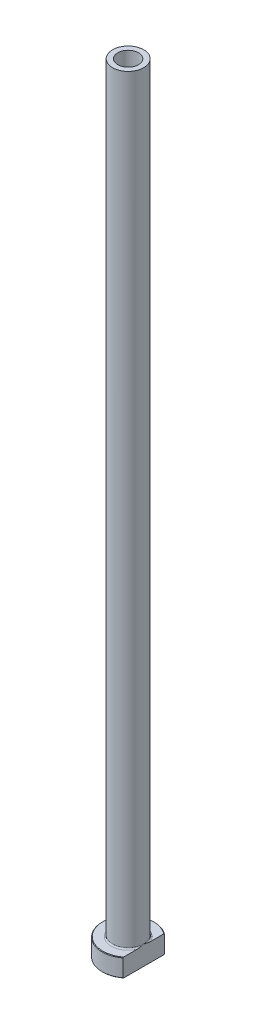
ISO-10303-21;
HEADER;
FILE_DESCRIPTION(('STEP AP214'),'2;1');
FILE_NAME('part.step','',(''),(''),'','','');
FILE_SCHEMA(('AUTOMOTIVE_DESIGN { 1 0 10303 214 1 1 1 1 }'));
ENDSEC;
DATA;
#1=APPLICATION_CONTEXT('core data for automotive mechanical design processes');
#2=APPLICATION_PROTOCOL_DEFINITION('international standard','automotive_design',2000,#1);
#3=PRODUCT_CONTEXT('',#1,'mechanical');
#4=PRODUCT('Part','Part','',(#3));
#5=PRODUCT_RELATED_PRODUCT_CATEGORY('part','',(#4));
#6=PRODUCT_DEFINITION_FORMATION('','',#4);
#7=PRODUCT_DEFINITION_CONTEXT('part definition',#1,'design');
#8=PRODUCT_DEFINITION('design','',#6,#7);
#9=PRODUCT_DEFINITION_SHAPE('','',#8);
#10=(LENGTH_UNIT() NAMED_UNIT(*) SI_UNIT(.MILLI.,.METRE.));
#11=(NAMED_UNIT(*) PLANE_ANGLE_UNIT() SI_UNIT($,.RADIAN.));
#12=(NAMED_UNIT(*) SI_UNIT($,.STERADIAN.) SOLID_ANGLE_UNIT());
#13=UNCERTAINTY_MEASURE_WITH_UNIT(LENGTH_MEASURE(1.E-05),#10,'distance_accuracy_value','');
#14=(GEOMETRIC_REPRESENTATION_CONTEXT(3) GLOBAL_UNCERTAINTY_ASSIGNED_CONTEXT((#13)) GLOBAL_UNIT_ASSIGNED_CONTEXT((#10,
#11,#12)) REPRESENTATION_CONTEXT('',''));
#15=CARTESIAN_POINT('',(0.,0.,0.));
#16=DIRECTION('',(0.,0.,1.));
#17=DIRECTION('',(1.,0.,0.));
#18=AXIS2_PLACEMENT_3D('',#15,#16,#17);
#19=CARTESIAN_POINT('',(0.,92.1876809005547,0.));
#20=DIRECTION('',(0.,1.,0.));
#21=DIRECTION('',(0.,0.,1.));
#22=AXIS2_PLACEMENT_3D('',#19,#20,#21);
#23=CYLINDRICAL_SURFACE('',#22,4.00000000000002);
#24=CARTESIAN_POINT('',(0.,300.,0.));
#25=DIRECTION('',(0.,1.,0.));
#26=DIRECTION('',(0.,0.,1.));
#27=AXIS2_PLACEMENT_3D('',#24,#25,#26);
#28=CIRCLE('',#27,4.00000000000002);
#29=CARTESIAN_POINT('',(0.,300.,4.00000000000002));
#30=VERTEX_POINT('',#29);
#31=EDGE_CURVE('E167',#30,#30,#28,.T.);
#32=ORIENTED_EDGE('',*,*,#31,.T.);
#33=EDGE_LOOP('',(#32));
#34=FACE_BOUND('',#33,.T.);
#35=CARTESIAN_POINT('',(0.,255.,0.));
#36=DIRECTION('',(0.,1.,0.));
#37=DIRECTION('',(0.,0.,1.));
#38=AXIS2_PLACEMENT_3D('',#35,#36,#37);
#39=CIRCLE('',#38,4.00000000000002);
#40=CARTESIAN_POINT('',(0.,255.,4.00000000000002));
#41=VERTEX_POINT('',#40);
#42=EDGE_CURVE('E170',#41,#41,#39,.T.);
#43=ORIENTED_EDGE('',*,*,#42,.F.);
#44=EDGE_LOOP('',(#43));
#45=FACE_BOUND('',#44,.T.);
#46=ADVANCED_FACE('F32',(#34,#45),#23,.F.);
#47=CARTESIAN_POINT('',(-4.00000000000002,300.,0.));
#48=DIRECTION('',(0.,1.,0.));
#49=DIRECTION('',(0.,0.,1.));
#50=AXIS2_PLACEMENT_3D('',#47,#48,#49);
#51=PLANE('',#50);
#52=CARTESIAN_POINT('',(0.,300.,0.));
#53=DIRECTION('',(0.,1.,0.));
#54=DIRECTION('',(0.,0.,1.));
#55=AXIS2_PLACEMENT_3D('',#52,#53,#54);
#56=CIRCLE('',#55,6.00000000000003);
#57=CARTESIAN_POINT('',(0.,300.,6.00000000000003));
#58=VERTEX_POINT('',#57);
#59=EDGE_CURVE('E174',#58,#58,#56,.T.);
#60=ORIENTED_EDGE('',*,*,#59,.T.);
#61=EDGE_LOOP('',(#60));
#62=FACE_BOUND('',#61,.T.);
#63=ORIENTED_EDGE('',*,*,#31,.F.);
#64=EDGE_LOOP('',(#63));
#65=FACE_BOUND('',#64,.T.);
#66=ADVANCED_FACE('F157',(#62,#65),#51,.T.);
#67=CARTESIAN_POINT('',(0.,92.1876809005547,0.));
#68=DIRECTION('',(0.,1.,0.));
#69=DIRECTION('',(0.,0.,1.));
#70=AXIS2_PLACEMENT_3D('',#67,#68,#69);
#71=CYLINDRICAL_SURFACE('',#70,6.00000000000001);
#72=CARTESIAN_POINT('',(0.,7.50000000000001,0.));
#73=DIRECTION('',(0.,1.,0.));
#74=DIRECTION('',(0.,0.,1.));
#75=AXIS2_PLACEMENT_3D('',#72,#73,#74);
#76=CIRCLE('',#75,6.00000000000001);
#77=CARTESIAN_POINT('',(6.,7.50000000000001,0.));
#78=VERTEX_POINT('',#77);
#79=EDGE_CURVE('E180',#78,#78,#76,.T.);
#80=ORIENTED_EDGE('',*,*,#79,.T.);
#81=EDGE_LOOP('',(#80));
#82=FACE_BOUND('',#81,.T.);
#83=ORIENTED_EDGE('',*,*,#59,.F.);
#84=EDGE_LOOP('',(#83));
#85=FACE_BOUND('',#84,.T.);
#86=ADVANCED_FACE('F162',(#82,#85),#71,.T.);
#87=CARTESIAN_POINT('',(-5.99999999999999,7.,0.));
#88=DIRECTION('',(0.,1.,0.));
#89=DIRECTION('',(0.,0.,1.));
#90=AXIS2_PLACEMENT_3D('',#87,#88,#89);
#91=PLANE('',#90);
#92=DIRECTION('',(0.,0.,1.));
#93=VECTOR('',#92,1.);
#94=CARTESIAN_POINT('',(6.,7.,0.));
#95=LINE('',#94,#93);
#96=CARTESIAN_POINT('',(6.,7.,-7.74854825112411));
#97=VERTEX_POINT('',#96);
#98=CARTESIAN_POINT('',(6.,7.,-2.50000000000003));
#99=VERTEX_POINT('',#98);
#100=EDGE_CURVE('E54',#97,#99,#95,.T.);
#101=ORIENTED_EDGE('',*,*,#100,.F.);
#102=CARTESIAN_POINT('',(0.,7.,0.));
#103=DIRECTION('',(0.,1.,0.));
#104=DIRECTION('',(0.,0.,1.));
#105=AXIS2_PLACEMENT_3D('',#102,#103,#104);
#106=CIRCLE('',#105,9.79999999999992);
#107=CARTESIAN_POINT('',(5.99999999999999,7.,7.74854825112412));
#108=VERTEX_POINT('',#107);
#109=EDGE_CURVE('E186',#97,#108,#106,.T.);
#110=ORIENTED_EDGE('',*,*,#109,.T.);
#111=CARTESIAN_POINT('',(6.,7.,2.50000000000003));
#112=VERTEX_POINT('',#111);
#113=EDGE_CURVE('E134',#112,#108,#95,.T.);
#114=ORIENTED_EDGE('',*,*,#113,.F.);
#115=CARTESIAN_POINT('',(0.,7.,0.));
#116=DIRECTION('',(0.,1.,0.));
#117=DIRECTION('',(0.,0.,1.));
#118=AXIS2_PLACEMENT_3D('',#115,#116,#117);
#119=CIRCLE('',#118,6.50000000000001);
#120=EDGE_CURVE('E183',#112,#99,#119,.F.);
#121=ORIENTED_EDGE('',*,*,#120,.T.);
#122=EDGE_LOOP('',(#101,#110,#114,#121));
#123=FACE_BOUND('',#122,.T.);
#124=ADVANCED_FACE('F197',(#123),#91,.T.);
#125=CARTESIAN_POINT('',(0.,92.1876809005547,0.));
#126=DIRECTION('',(0.,1.,0.));
#127=DIRECTION('',(0.,0.,1.));
#128=AXIS2_PLACEMENT_3D('',#125,#126,#127);
#129=CYLINDRICAL_SURFACE('',#128,9.99999999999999);
#130=DIRECTION('',(0.,-1.,0.));
#131=VECTOR('',#130,1.);
#132=CARTESIAN_POINT('',(5.99999999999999,300.,7.99999999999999));
#133=LINE('',#132,#131);
#134=CARTESIAN_POINT('',(5.99999999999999,6.79999999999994,7.99999999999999));
#135=VERTEX_POINT('',#134);
#136=CARTESIAN_POINT('',(5.99999999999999,0.200000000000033,7.99999999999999));
#137=VERTEX_POINT('',#136);
#138=EDGE_CURVE('E82',#135,#137,#133,.T.);
#139=ORIENTED_EDGE('',*,*,#138,.F.);
#140=CARTESIAN_POINT('',(0.,6.79999999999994,0.));
#141=DIRECTION('',(0.,1.,0.));
#142=DIRECTION('',(0.,0.,1.));
#143=AXIS2_PLACEMENT_3D('',#140,#141,#142);
#144=CIRCLE('',#143,9.99999999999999);
#145=CARTESIAN_POINT('',(6.,6.79999999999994,-7.99999999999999));
#146=VERTEX_POINT('',#145);
#147=EDGE_CURVE('E95',#135,#146,#144,.F.);
#148=ORIENTED_EDGE('',*,*,#147,.T.);
#149=DIRECTION('',(0.,-1.,0.));
#150=VECTOR('',#149,1.);
#151=CARTESIAN_POINT('',(6.,300.,-7.99999999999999));
#152=LINE('',#151,#150);
#153=CARTESIAN_POINT('',(6.,0.200000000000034,-7.99999999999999));
#154=VERTEX_POINT('',#153);
#155=EDGE_CURVE('E192',#146,#154,#152,.T.);
#156=ORIENTED_EDGE('',*,*,#155,.T.);
#157=CARTESIAN_POINT('',(0.,0.200000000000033,0.));
#158=DIRECTION('',(0.,-1.,0.));
#159=DIRECTION('',(0.,0.,-1.));
#160=AXIS2_PLACEMENT_3D('',#157,#158,#159);
#161=CIRCLE('',#160,9.99999999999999);
#162=EDGE_CURVE('E98',#154,#137,#161,.F.);
#163=ORIENTED_EDGE('',*,*,#162,.T.);
#164=EDGE_LOOP('',(#139,#148,#156,#163));
#165=FACE_BOUND('',#164,.T.);
#166=ADVANCED_FACE('F190',(#165),#129,.T.);
#167=CARTESIAN_POINT('',(-9.99999999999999,0.,0.));
#168=DIRECTION('',(0.,-1.,0.));
#169=DIRECTION('',(0.,0.,-1.));
#170=AXIS2_PLACEMENT_3D('',#167,#168,#169);
#171=PLANE('',#170);
#172=CARTESIAN_POINT('',(0.,0.,0.));
#173=DIRECTION('',(0.,-1.,0.));
#174=DIRECTION('',(0.,0.,-1.));
#175=AXIS2_PLACEMENT_3D('',#172,#173,#174);
#176=CIRCLE('',#175,4.75);
#177=CARTESIAN_POINT('',(0.,0.,-4.75));
#178=VERTEX_POINT('',#177);
#179=EDGE_CURVE('E40',#178,#178,#176,.F.);
#180=ORIENTED_EDGE('',*,*,#179,.T.);
#181=EDGE_LOOP('',(#180));
#182=FACE_BOUND('',#181,.T.);
#183=DIRECTION('',(0.,0.,-1.));
#184=VECTOR('',#183,1.);
#185=CARTESIAN_POINT('',(5.99999999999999,0.,7.99999999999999));
#186=LINE('',#185,#184);
#187=CARTESIAN_POINT('',(5.99999999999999,0.,7.74854825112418));
#188=VERTEX_POINT('',#187);
#189=CARTESIAN_POINT('',(6.,0.,-7.74854825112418));
#190=VERTEX_POINT('',#189);
#191=EDGE_CURVE('E47',#188,#190,#186,.T.);
#192=ORIENTED_EDGE('',*,*,#191,.F.);
#193=CARTESIAN_POINT('',(0.,0.,0.));
#194=DIRECTION('',(0.,-1.,0.));
#195=DIRECTION('',(0.,0.,-1.));
#196=AXIS2_PLACEMENT_3D('',#193,#194,#195);
#197=CIRCLE('',#196,9.79999999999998);
#198=EDGE_CURVE('E92',#188,#190,#197,.T.);
#199=ORIENTED_EDGE('',*,*,#198,.T.);
#200=EDGE_LOOP('',(#192,#199));
#201=FACE_BOUND('',#200,.T.);
#202=ADVANCED_FACE('F91',(#182,#201),#171,.T.);
#203=CARTESIAN_POINT('',(0.,92.1876809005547,0.));
#204=DIRECTION('',(0.,1.,0.));
#205=DIRECTION('',(0.,0.,1.));
#206=AXIS2_PLACEMENT_3D('',#203,#204,#205);
#207=CYLINDRICAL_SURFACE('',#206,4.25000000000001);
#208=CARTESIAN_POINT('',(0.,0.500000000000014,0.));
#209=DIRECTION('',(0.,-1.,0.));
#210=DIRECTION('',(0.,0.,-1.));
#211=AXIS2_PLACEMENT_3D('',#208,#209,#210);
#212=CIRCLE('',#211,4.25000000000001);
#213=CARTESIAN_POINT('',(0.,0.500000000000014,-4.25000000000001));
#214=VERTEX_POINT('',#213);
#215=EDGE_CURVE('E11',#214,#214,#212,.T.);
#216=ORIENTED_EDGE('',*,*,#215,.T.);
#217=EDGE_LOOP('',(#216));
#218=FACE_BOUND('',#217,.T.);
#219=CARTESIAN_POINT('',(0.,243.,0.));
#220=DIRECTION('',(0.,1.,0.));
#221=DIRECTION('',(0.,0.,1.));
#222=AXIS2_PLACEMENT_3D('',#219,#220,#221);
#223=CIRCLE('',#222,4.25000000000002);
#224=CARTESIAN_POINT('',(0.,243.,4.25000000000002));
#225=VERTEX_POINT('',#224);
#226=EDGE_CURVE('E172',#225,#225,#223,.T.);
#227=ORIENTED_EDGE('',*,*,#226,.T.);
#228=EDGE_LOOP('',(#227));
#229=FACE_BOUND('',#228,.T.);
#230=ADVANCED_FACE('F215',(#218,#229),#207,.F.);
#231=CARTESIAN_POINT('',(0.,243.,0.));
#232=DIRECTION('',(0.,-1.,0.));
#233=DIRECTION('',(0.,0.,-1.));
#234=AXIS2_PLACEMENT_3D('',#231,#232,#233);
#235=CONICAL_SURFACE('',#234,4.25000000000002,0.0208303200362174);
#236=ORIENTED_EDGE('',*,*,#42,.T.);
#237=EDGE_LOOP('',(#236));
#238=FACE_BOUND('',#237,.T.);
#239=ORIENTED_EDGE('',*,*,#226,.F.);
#240=EDGE_LOOP('',(#239));
#241=FACE_BOUND('',#240,.T.);
#242=ADVANCED_FACE('F111',(#238,#241),#235,.F.);
#243=CARTESIAN_POINT('',(0.,7.50000000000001,0.));
#244=DIRECTION('',(0.,1.,0.));
#245=DIRECTION('',(0.,0.,1.));
#246=AXIS2_PLACEMENT_3D('',#243,#244,#245);
#247=TOROIDAL_SURFACE('',#246,6.50000000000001,0.5);
#248=ORIENTED_EDGE('',*,*,#120,.F.);
#249=CARTESIAN_POINT('',(6.,7.50000000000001,0.));
#250=CARTESIAN_POINT('',(6.,7.50000080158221,6.70580405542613E-11));
#251=CARTESIAN_POINT('',(6.,7.5000016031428,2.62462853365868E-07));
#252=CARTESIAN_POINT('',(6.,7.50000311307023,1.01907229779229E-06));
#253=CARTESIAN_POINT('',(6.,7.50000381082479,1.52837979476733E-06));
#254=CARTESIAN_POINT('',(6.,7.50000523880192,2.74467686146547E-06));
#255=CARTESIAN_POINT('',(6.,7.50000595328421,3.47066811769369E-06));
#256=CARTESIAN_POINT('',(6.,7.50000725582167,4.99336283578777E-06));
#257=CARTESIAN_POINT('',(6.,7.50000784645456,5.78800222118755E-06));
#258=CARTESIAN_POINT('',(6.,7.50000997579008,8.79661743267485E-06));
#259=CARTESIAN_POINT('',(6.,7.50001139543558,1.1098069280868E-05));
#260=CARTESIAN_POINT('',(6.,7.50001378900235,1.5711611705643E-05));
#261=CARTESIAN_POINT('',(6.,7.50001478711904,1.80117463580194E-05));
#262=CARTESIAN_POINT('',(6.,7.50001885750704,2.75423873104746E-05));
#263=CARTESIAN_POINT('',(6.,7.50002181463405,3.48285128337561E-05));
#264=CARTESIAN_POINT('',(6.,7.50002628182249,4.87408453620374E-05));
#265=CARTESIAN_POINT('',(6.,7.50002793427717,5.53214434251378E-05));
#266=CARTESIAN_POINT('',(6.,7.50003978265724,0.00010360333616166));
#267=CARTESIAN_POINT('',(6.,7.50004857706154,0.000145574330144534));
#268=CARTESIAN_POINT('',(6.,7.50008704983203,0.000310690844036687));
#269=CARTESIAN_POINT('',(6.,7.50012394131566,0.000432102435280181));
#270=CARTESIAN_POINT('',(6.,7.50026686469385,0.000911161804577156));
#271=CARTESIAN_POINT('',(6.,7.50036807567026,0.00126981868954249));
#272=CARTESIAN_POINT('',(6.,7.50077195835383,0.00268961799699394));
#273=CARTESIAN_POINT('',(6.,7.5010805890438,0.00374948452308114));
#274=CARTESIAN_POINT('',(6.,7.50236320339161,0.0081665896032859));
#275=CARTESIAN_POINT('',(6.,7.5033297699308,0.0115254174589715));
#276=CARTESIAN_POINT('',(5.99999999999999,7.51709820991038,0.059354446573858));
#277=CARTESIAN_POINT('',(6.,7.52995465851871,0.103813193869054));
#278=CARTESIAN_POINT('',(6.,7.55506029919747,0.190977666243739));
#279=CARTESIAN_POINT('',(6.,7.56731321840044,0.233682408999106));
#280=CARTESIAN_POINT('',(6.,7.59325665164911,0.324512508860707));
#281=CARTESIAN_POINT('',(6.,7.60693346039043,0.372641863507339));
#282=CARTESIAN_POINT('',(6.,7.63422038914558,0.469489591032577));
#283=CARTESIAN_POINT('',(6.,7.6478281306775,0.518208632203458));
#284=CARTESIAN_POINT('',(6.,7.68043734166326,0.636338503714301));
#285=CARTESIAN_POINT('',(6.,7.69928754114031,0.705791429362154));
#286=CARTESIAN_POINT('',(6.,7.73566887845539,0.84310273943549));
#287=CARTESIAN_POINT('',(6.,7.75322160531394,0.910955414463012));
#288=CARTESIAN_POINT('',(6.,7.80024878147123,1.09857433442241));
#289=CARTESIAN_POINT('',(6.,7.82864900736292,1.21861610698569));
#290=CARTESIAN_POINT('',(6.,7.88105633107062,1.46081534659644));
#291=CARTESIAN_POINT('',(6.,7.90502088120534,1.58298212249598));
#292=CARTESIAN_POINT('',(6.,7.94810499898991,1.83866408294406));
#293=CARTESIAN_POINT('',(6.,7.96665856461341,1.97228081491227));
#294=CARTESIAN_POINT('',(6.,7.9862169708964,2.17329578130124));
#295=CARTESIAN_POINT('',(6.,7.99135613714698,2.24029152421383));
#296=CARTESIAN_POINT('',(6.,7.99832928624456,2.37444824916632));
#297=CARTESIAN_POINT('',(6.,8.00016429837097,2.44160917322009));
#298=CARTESIAN_POINT('',(6.,7.99984674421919,2.56298631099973));
#299=CARTESIAN_POINT('',(6.,7.99839439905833,2.6172032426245));
#300=CARTESIAN_POINT('',(6.,7.9923655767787,2.72552036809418));
#301=CARTESIAN_POINT('',(6.,7.98778645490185,2.77962042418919));
#302=CARTESIAN_POINT('',(6.,7.97492915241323,2.88664710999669));
#303=CARTESIAN_POINT('',(6.,7.96670262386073,2.939579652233));
#304=CARTESIAN_POINT('',(6.,7.94570253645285,3.0444833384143));
#305=CARTESIAN_POINT('',(6.,7.93293488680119,3.09645563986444));
#306=CARTESIAN_POINT('',(6.,7.90135968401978,3.19943606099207));
#307=CARTESIAN_POINT('',(6.,7.88247175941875,3.25042120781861));
#308=CARTESIAN_POINT('',(6.,7.84818685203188,3.32403783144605));
#309=CARTESIAN_POINT('',(6.,7.83579052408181,3.34806431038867));
#310=CARTESIAN_POINT('',(6.,7.80866016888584,3.39474488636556));
#311=CARTESIAN_POINT('',(6.,7.7939296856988,3.41740099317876));
#312=CARTESIAN_POINT('',(6.,7.76577135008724,3.4552417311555));
#313=CARTESIAN_POINT('',(6.,7.75294719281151,3.4708726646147));
#314=CARTESIAN_POINT('',(6.,7.72556313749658,3.50058040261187));
#315=CARTESIAN_POINT('',(6.,7.71100204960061,3.51465612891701));
#316=CARTESIAN_POINT('',(6.,7.67984897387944,3.54077006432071));
#317=CARTESIAN_POINT('',(6.,7.66323651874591,3.55278430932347));
#318=CARTESIAN_POINT('',(6.,7.62815222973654,3.57370259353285));
#319=CARTESIAN_POINT('',(6.,7.6096850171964,3.58261412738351));
#320=CARTESIAN_POINT('',(6.,7.57639898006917,3.59454653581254));
#321=CARTESIAN_POINT('',(6.,7.56191673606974,3.59850385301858));
#322=CARTESIAN_POINT('',(6.,7.53249228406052,3.60392336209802));
#323=CARTESIAN_POINT('',(6.,7.51755044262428,3.60538749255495));
#324=CARTESIAN_POINT('',(6.,7.48761833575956,3.60568912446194));
#325=CARTESIAN_POINT('',(6.,7.47262803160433,3.60452285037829));
#326=CARTESIAN_POINT('',(6.,7.4430627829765,3.59966500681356));
#327=CARTESIAN_POINT('',(6.,7.4284881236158,3.59597174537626));
#328=CARTESIAN_POINT('',(6.,7.39702156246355,3.58531109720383));
#329=CARTESIAN_POINT('',(6.,7.38031267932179,3.57780732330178));
#330=CARTESIAN_POINT('',(6.,7.34834450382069,3.56018434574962));
#331=CARTESIAN_POINT('',(6.,7.33308764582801,3.5500608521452));
#332=CARTESIAN_POINT('',(6.,7.29715308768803,3.52252389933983));
#333=CARTESIAN_POINT('',(6.,7.27737832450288,3.50394102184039));
#334=CARTESIAN_POINT('',(6.,7.24088410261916,3.463995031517));
#335=CARTESIAN_POINT('',(6.,7.22417302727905,3.44262455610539));
#336=CARTESIAN_POINT('',(6.,7.18148338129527,3.38088102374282));
#337=CARTESIAN_POINT('',(6.,7.1583178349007,3.33858120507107));
#338=CARTESIAN_POINT('',(6.,7.1182274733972,3.25128083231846));
#339=CARTESIAN_POINT('',(6.,7.10130560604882,3.20627901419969));
#340=CARTESIAN_POINT('',(6.,7.07193388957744,3.11375892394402));
#341=CARTESIAN_POINT('',(6.,7.05959256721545,3.06620687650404));
#342=CARTESIAN_POINT('',(6.,7.03888782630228,2.97022063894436));
#343=CARTESIAN_POINT('',(6.,7.03052890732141,2.92178551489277));
#344=CARTESIAN_POINT('',(6.,7.01697563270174,2.82374574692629));
#345=CARTESIAN_POINT('',(6.,7.01183067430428,2.77413446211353));
#346=CARTESIAN_POINT('',(6.,7.004350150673,2.67475263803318));
#347=CARTESIAN_POINT('',(6.,7.00201229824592,2.62498226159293));
#348=CARTESIAN_POINT('',(6.,6.9989719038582,2.49377014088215));
#349=CARTESIAN_POINT('',(6.,7.00025005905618,2.41228296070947));
#350=CARTESIAN_POINT('',(6.,7.00775652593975,2.24952135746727));
#351=CARTESIAN_POINT('',(6.,7.01398784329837,2.1682470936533));
#352=CARTESIAN_POINT('',(6.,7.03045087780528,2.00575531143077));
#353=CARTESIAN_POINT('',(6.,7.04070001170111,1.92453960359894));
#354=CARTESIAN_POINT('',(6.,7.06442774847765,1.76257601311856));
#355=CARTESIAN_POINT('',(6.,7.07790697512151,1.68182822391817));
#356=CARTESIAN_POINT('',(6.,7.11973611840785,1.45394312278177));
#357=CARTESIAN_POINT('',(6.,7.15113840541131,1.30736987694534));
#358=CARTESIAN_POINT('',(6.,7.2192714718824,1.01717316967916));
#359=CARTESIAN_POINT('',(6.,7.25594155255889,0.873534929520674));
#360=CARTESIAN_POINT('',(6.,7.30765759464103,0.680321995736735));
#361=CARTESIAN_POINT('',(6.,7.32124979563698,0.630351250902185));
#362=CARTESIAN_POINT('',(6.,7.34913735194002,0.529103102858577));
#363=CARTESIAN_POINT('',(6.,7.36344174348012,0.47782818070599));
#364=CARTESIAN_POINT('',(6.,7.38809313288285,0.390268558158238));
#365=CARTESIAN_POINT('',(6.,7.39837954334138,0.35396670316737));
#366=CARTESIAN_POINT('',(6.,7.41893445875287,0.281778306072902));
#367=CARTESIAN_POINT('',(6.,7.42920197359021,0.245891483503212));
#368=CARTESIAN_POINT('',(6.,7.4486400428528,0.178137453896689));
#369=CARTESIAN_POINT('',(6.,7.45780513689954,0.14626862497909));
#370=CARTESIAN_POINT('',(6.,7.47656016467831,0.0812304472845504));
#371=CARTESIAN_POINT('',(5.99999999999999,7.48615204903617,0.0480615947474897));
#372=CARTESIAN_POINT('',(6.,7.49666961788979,0.0115277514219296));
#373=CARTESIAN_POINT('',(6.,7.49763547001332,0.00817123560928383));
#374=CARTESIAN_POINT('',(6.,7.49891791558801,0.00375466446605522));
#375=CARTESIAN_POINT('',(6.,7.49922706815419,0.00269301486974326));
#376=CARTESIAN_POINT('',(6.,7.4996315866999,0.00127098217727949));
#377=CARTESIAN_POINT('',(6.,7.49973292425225,0.000911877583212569));
#378=CARTESIAN_POINT('',(6.,7.49987600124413,0.000432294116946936));
#379=CARTESIAN_POINT('',(6.,7.49991291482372,0.000310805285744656));
#380=CARTESIAN_POINT('',(6.,7.49995140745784,0.000145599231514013));
#381=CARTESIAN_POINT('',(6.,7.49996020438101,0.000103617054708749));
#382=CARTESIAN_POINT('',(6.,7.49997205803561,5.53238254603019E-05));
#383=CARTESIAN_POINT('',(6.,7.4999737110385,4.87425734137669E-05));
#384=CARTESIAN_POINT('',(6.,7.49997817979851,3.48289289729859E-05));
#385=CARTESIAN_POINT('',(6.,7.49998113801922,2.75421797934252E-05));
#386=CARTESIAN_POINT('',(6.,7.49998520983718,1.80109022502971E-05));
#387=CARTESIAN_POINT('',(6.,7.49998620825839,1.57107185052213E-05));
#388=CARTESIAN_POINT('',(6.,7.49998860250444,1.10971307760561E-05));
#389=CARTESIAN_POINT('',(6.,7.49999002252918,8.79568824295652E-06));
#390=CARTESIAN_POINT('',(6.,7.49999215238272,5.78714797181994E-06));
#391=CARTESIAN_POINT('',(6.,7.49999274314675,4.99254452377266E-06));
#392=CARTESIAN_POINT('',(6.,7.49999404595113,3.4699453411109E-06));
#393=CARTESIAN_POINT('',(6.,7.49999476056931,2.74401434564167E-06));
#394=CARTESIAN_POINT('',(6.,7.4999961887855,1.52786028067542E-06));
#395=CARTESIAN_POINT('',(6.,7.49999688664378,1.01863071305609E-06));
#396=CARTESIAN_POINT('',(6.,7.49999839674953,2.62215717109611E-07));
#397=CARTESIAN_POINT('',(6.,7.49999919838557,-6.70594361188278E-11));
#398=CARTESIAN_POINT('',(6.,7.50000000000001,0.));
#399=B_SPLINE_CURVE_WITH_KNOTS('',3,(#249,#250,#251,#252,#253,#254,#255,#256,#257,#258,#259,
#260,#261,#262,#263,#264,#265,#266,#267,#268,#269,#270,#271,#272,#273,#274,#275,#276,#277,#278,
#279,#280,#281,#282,#283,#284,#285,#286,#287,#288,#289,#290,#291,#292,#293,#294,#295,#296,#297,
#298,#299,#300,#301,#302,#303,#304,#305,#306,#307,#308,#309,#310,#311,#312,#313,#314,#315,#316,
#317,#318,#319,#320,#321,#322,#323,#324,#325,#326,#327,#328,#329,#330,#331,#332,#333,#334,#335,
#336,#337,#338,#339,#340,#341,#342,#343,#344,#345,#346,#347,#348,#349,#350,#351,#352,#353,#354,
#355,#356,#357,#358,#359,#360,#361,#362,#363,#364,#365,#366,#367,#368,#369,#370,#371,#372,#373,
#374,#375,#376,#377,#378,#379,#380,#381,#382,#383,#384,#385,#386,#387,#388,#389,#390,#391,#392,
#393,#394,#395,#396,#397,#398),.UNSPECIFIED.,.T.,.F.,(4,2,2,2,2,2,2,2,2,2,2,2,2,2,2,2,2,2,2,2,2,
2,2,2,2,2,2,2,2,2,2,2,2,2,2,2,2,2,2,2,2,2,2,2,2,2,2,2,2,2,2,2,2,2,2,2,2,2,2,2,2,2,2,2,2,2,2,2,2,
2,2,2,2,2,4),(0.,2.41532746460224E-06,5.00161593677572E-06,8.04115707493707E-06,
1.10092280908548E-05,1.90889703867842E-05,2.66047326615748E-05,5.01454034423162E-05,
7.04739966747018E-05,0.000199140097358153,0.000579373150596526,0.00169781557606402,
0.00500893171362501,0.0154949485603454,0.154330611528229,0.287615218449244,0.437719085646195,
0.589470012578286,0.80536187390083,1.01561737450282,1.38561400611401,1.75899405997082,
2.16331287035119,2.36482907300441,2.56628249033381,2.72891861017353,2.89169246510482,
3.05223140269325,3.21256219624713,3.37509011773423,3.45609970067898,3.53698744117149,
3.59753760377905,3.65812948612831,3.71938396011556,3.78048942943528,3.82533702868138,
3.87014974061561,3.91502681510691,3.95993396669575,4.01458097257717,4.06931803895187,
4.15026803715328,4.23143634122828,4.37530581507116,4.51924312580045,4.66640085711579,
4.81372446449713,4.96325999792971,5.11267360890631,5.35695170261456,5.60137814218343,
5.84687607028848,6.09242144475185,6.54191534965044,6.98659302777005,7.14195169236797,
7.3016489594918,7.41484221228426,7.52682205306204,7.62630458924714,7.72988447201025,
7.74036324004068,7.74367992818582,7.74479976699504,7.74518024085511,7.74530894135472,
7.74532927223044,7.74535281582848,7.7453603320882,7.7453684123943,7.74537138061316,
7.74537442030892,7.74537700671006,7.74537942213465),.UNSPECIFIED.);
#400=EDGE_CURVE('E126',#112,#78,#399,.T.);
#401=ORIENTED_EDGE('',*,*,#400,.T.);
#402=ORIENTED_EDGE('',*,*,#79,.F.);
#403=CARTESIAN_POINT('',(6.,7.50000000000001,0.));
#404=CARTESIAN_POINT('',(6.,7.49999919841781,-6.7056795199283E-11));
#405=CARTESIAN_POINT('',(6.,7.49999839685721,-2.62462852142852E-07));
#406=CARTESIAN_POINT('',(6.,7.49999688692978,-1.01907229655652E-06));
#407=CARTESIAN_POINT('',(6.,7.49999618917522,-1.52837979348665E-06));
#408=CARTESIAN_POINT('',(6.,7.4999947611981,-2.7446768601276E-06));
#409=CARTESIAN_POINT('',(6.,7.49999404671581,-3.47066811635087E-06));
#410=CARTESIAN_POINT('',(6.,7.49999274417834,-4.99336283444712E-06));
#411=CARTESIAN_POINT('',(6.,7.49999215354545,-5.78800221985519E-06));
#412=CARTESIAN_POINT('',(6.,7.49999002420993,-8.79661743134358E-06));
#413=CARTESIAN_POINT('',(6.,7.49998860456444,-1.10980692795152E-05));
#414=CARTESIAN_POINT('',(6.,7.49998621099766,-1.57116117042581E-05));
#415=CARTESIAN_POINT('',(6.,7.49998521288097,-1.80117463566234E-05));
#416=CARTESIAN_POINT('',(6.,7.49998114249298,-2.75423873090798E-05));
#417=CARTESIAN_POINT('',(6.,7.49997818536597,-3.48285128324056E-05));
#418=CARTESIAN_POINT('',(6.,7.49997371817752,-4.87408453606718E-05));
#419=CARTESIAN_POINT('',(6.,7.49997206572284,-5.53214434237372E-05));
#420=CARTESIAN_POINT('',(6.,7.49996021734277,-0.000103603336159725));
#421=CARTESIAN_POINT('',(6.,7.49995142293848,-0.000145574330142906));
#422=CARTESIAN_POINT('',(6.,7.49991295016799,-0.000310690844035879));
#423=CARTESIAN_POINT('',(6.,7.49987605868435,-0.000432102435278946));
#424=CARTESIAN_POINT('',(6.,7.49973313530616,-0.000911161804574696));
#425=CARTESIAN_POINT('',(6.,7.49963192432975,-0.00126981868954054));
#426=CARTESIAN_POINT('',(6.,7.49922804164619,-0.00268961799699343));
#427=CARTESIAN_POINT('',(6.,7.49891941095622,-0.00374948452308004));
#428=CARTESIAN_POINT('',(6.,7.4976367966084,-0.00816658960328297));
#429=CARTESIAN_POINT('',(6.,7.49667023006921,-0.0115254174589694));
#430=CARTESIAN_POINT('',(5.99999999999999,7.48290179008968,-0.059354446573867));
#431=CARTESIAN_POINT('',(6.,7.47004534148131,-0.103813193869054));
#432=CARTESIAN_POINT('',(6.,7.44493970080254,-0.190977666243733));
#433=CARTESIAN_POINT('',(6.,7.43268678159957,-0.233682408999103));
#434=CARTESIAN_POINT('',(6.,7.40674334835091,-0.324512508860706));
#435=CARTESIAN_POINT('',(6.,7.39306653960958,-0.372641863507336));
#436=CARTESIAN_POINT('',(6.,7.36577961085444,-0.469489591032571));
#437=CARTESIAN_POINT('',(6.,7.35217186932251,-0.518208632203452));
#438=CARTESIAN_POINT('',(6.,7.31956265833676,-0.636338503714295));
#439=CARTESIAN_POINT('',(6.,7.3007124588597,-0.705791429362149));
#440=CARTESIAN_POINT('',(6.,7.26433112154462,-0.843102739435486));
#441=CARTESIAN_POINT('',(6.,7.24677839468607,-0.910955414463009));
#442=CARTESIAN_POINT('',(6.,7.19975121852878,-1.09857433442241));
#443=CARTESIAN_POINT('',(6.,7.17135099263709,-1.21861610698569));
#444=CARTESIAN_POINT('',(6.,7.11894366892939,-1.46081534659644));
#445=CARTESIAN_POINT('',(6.,7.09497911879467,-1.58298212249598));
#446=CARTESIAN_POINT('',(6.,7.05189500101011,-1.83866408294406));
#447=CARTESIAN_POINT('',(6.,7.03334143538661,-1.97228081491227));
#448=CARTESIAN_POINT('',(6.,7.01378302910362,-2.17329578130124));
#449=CARTESIAN_POINT('',(6.,7.00864386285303,-2.24029152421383));
#450=CARTESIAN_POINT('',(6.,7.00167071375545,-2.37444824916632));
#451=CARTESIAN_POINT('',(6.,6.99983570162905,-2.44160917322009));
#452=CARTESIAN_POINT('',(6.,7.00015325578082,-2.56298631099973));
#453=CARTESIAN_POINT('',(6.,7.00160560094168,-2.6172032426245));
#454=CARTESIAN_POINT('',(6.,7.00763442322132,-2.72552036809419));
#455=CARTESIAN_POINT('',(6.,7.01221354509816,-2.77962042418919));
#456=CARTESIAN_POINT('',(6.,7.02507084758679,-2.88664710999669));
#457=CARTESIAN_POINT('',(6.,7.03329737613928,-2.93957965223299));
#458=CARTESIAN_POINT('',(6.,7.05429746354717,-3.0444833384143));
#459=CARTESIAN_POINT('',(6.,7.06706511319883,-3.09645563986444));
#460=CARTESIAN_POINT('',(6.,7.09864031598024,-3.19943606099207));
#461=CARTESIAN_POINT('',(6.,7.11752824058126,-3.2504212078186));
#462=CARTESIAN_POINT('',(6.,7.15181314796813,-3.32403783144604));
#463=CARTESIAN_POINT('',(6.,7.1642094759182,-3.34806431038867));
#464=CARTESIAN_POINT('',(6.,7.19133983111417,-3.39474488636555));
#465=CARTESIAN_POINT('',(6.,7.20607031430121,-3.41740099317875));
#466=CARTESIAN_POINT('',(6.,7.23422864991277,-3.45524173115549));
#467=CARTESIAN_POINT('',(6.,7.2470528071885,-3.47087266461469));
#468=CARTESIAN_POINT('',(6.,7.27443686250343,-3.50058040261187));
#469=CARTESIAN_POINT('',(6.,7.2889979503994,-3.514656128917));
#470=CARTESIAN_POINT('',(6.,7.32015102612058,-3.54077006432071));
#471=CARTESIAN_POINT('',(6.,7.33676348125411,-3.55278430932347));
#472=CARTESIAN_POINT('',(6.,7.37184777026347,-3.57370259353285));
#473=CARTESIAN_POINT('',(6.,7.39031498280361,-3.58261412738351));
#474=CARTESIAN_POINT('',(6.,7.42360101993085,-3.59454653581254));
#475=CARTESIAN_POINT('',(6.,7.43808326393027,-3.59850385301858));
#476=CARTESIAN_POINT('',(6.,7.46750771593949,-3.60392336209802));
#477=CARTESIAN_POINT('',(6.,7.48244955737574,-3.60538749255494));
#478=CARTESIAN_POINT('',(6.,7.51238166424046,-3.60568912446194));
#479=CARTESIAN_POINT('',(6.,7.52737196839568,-3.60452285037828));
#480=CARTESIAN_POINT('',(6.,7.55693721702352,-3.59966500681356));
#481=CARTESIAN_POINT('',(6.,7.57151187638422,-3.59597174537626));
#482=CARTESIAN_POINT('',(6.,7.60297843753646,-3.58531109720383));
#483=CARTESIAN_POINT('',(6.,7.61968732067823,-3.57780732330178));
#484=CARTESIAN_POINT('',(6.,7.65165549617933,-3.56018434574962));
#485=CARTESIAN_POINT('',(6.,7.666912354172,-3.5500608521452));
#486=CARTESIAN_POINT('',(6.,7.70284691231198,-3.52252389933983));
#487=CARTESIAN_POINT('',(6.,7.72262167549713,-3.50394102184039));
#488=CARTESIAN_POINT('',(6.,7.75911589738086,-3.463995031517));
#489=CARTESIAN_POINT('',(6.,7.77582697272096,-3.44262455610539));
#490=CARTESIAN_POINT('',(6.,7.81851661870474,-3.38088102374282));
#491=CARTESIAN_POINT('',(6.,7.84168216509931,-3.33858120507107));
#492=CARTESIAN_POINT('',(6.,7.88177252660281,-3.25128083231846));
#493=CARTESIAN_POINT('',(6.,7.8986943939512,-3.20627901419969));
#494=CARTESIAN_POINT('',(6.,7.92806611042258,-3.11375892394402));
#495=CARTESIAN_POINT('',(6.,7.94040743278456,-3.06620687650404));
#496=CARTESIAN_POINT('',(6.,7.96111217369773,-2.97022063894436));
#497=CARTESIAN_POINT('',(6.,7.9694710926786,-2.92178551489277));
#498=CARTESIAN_POINT('',(6.,7.98302436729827,-2.82374574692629));
#499=CARTESIAN_POINT('',(6.,7.98816932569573,-2.77413446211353));
#500=CARTESIAN_POINT('',(6.,7.99564984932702,-2.67475263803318));
#501=CARTESIAN_POINT('',(6.,7.99798770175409,-2.62498226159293));
#502=CARTESIAN_POINT('',(6.,8.00102809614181,-2.49377014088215));
#503=CARTESIAN_POINT('',(6.,7.99974994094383,-2.41228296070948));
#504=CARTESIAN_POINT('',(6.,7.99224347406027,-2.24952135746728));
#505=CARTESIAN_POINT('',(6.,7.98601215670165,-2.16824709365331));
#506=CARTESIAN_POINT('',(6.,7.96954912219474,-2.00575531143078));
#507=CARTESIAN_POINT('',(6.,7.9592999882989,-1.92453960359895));
#508=CARTESIAN_POINT('',(6.,7.93557225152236,-1.76257601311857));
#509=CARTESIAN_POINT('',(6.,7.92209302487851,-1.68182822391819));
#510=CARTESIAN_POINT('',(6.,7.88026388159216,-1.45394312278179));
#511=CARTESIAN_POINT('',(6.,7.84886159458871,-1.30736987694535));
#512=CARTESIAN_POINT('',(6.,7.78072852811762,-1.01717316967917));
#513=CARTESIAN_POINT('',(6.,7.74405844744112,-0.873534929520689));
#514=CARTESIAN_POINT('',(6.,7.69234240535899,-0.680321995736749));
#515=CARTESIAN_POINT('',(6.,7.67875020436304,-0.630351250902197));
#516=CARTESIAN_POINT('',(6.,7.65086264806,-0.529103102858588));
#517=CARTESIAN_POINT('',(6.,7.63655825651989,-0.477828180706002));
#518=CARTESIAN_POINT('',(6.,7.61190686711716,-0.390268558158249));
#519=CARTESIAN_POINT('',(6.,7.60162045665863,-0.353966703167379));
#520=CARTESIAN_POINT('',(6.,7.58106554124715,-0.281778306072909));
#521=CARTESIAN_POINT('',(6.,7.57079802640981,-0.245891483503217));
#522=CARTESIAN_POINT('',(6.,7.55135995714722,-0.178137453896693));
#523=CARTESIAN_POINT('',(6.,7.54219486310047,-0.146268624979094));
#524=CARTESIAN_POINT('',(6.,7.52343983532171,-0.0812304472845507));
#525=CARTESIAN_POINT('',(5.99999999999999,7.51384795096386,-0.0480615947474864));
#526=CARTESIAN_POINT('',(6.,7.50333038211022,-0.0115277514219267));
#527=CARTESIAN_POINT('',(6.,7.50236452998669,-0.00817123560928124));
#528=CARTESIAN_POINT('',(6.,7.50108208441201,-0.00375466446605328));
#529=CARTESIAN_POINT('',(6.,7.50077293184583,-0.00269301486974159));
#530=CARTESIAN_POINT('',(6.,7.50036841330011,-0.00127098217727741));
#531=CARTESIAN_POINT('',(6.,7.50026707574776,-0.000911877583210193));
#532=CARTESIAN_POINT('',(6.,7.50012399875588,-0.000432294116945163));
#533=CARTESIAN_POINT('',(6.,7.50008708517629,-0.00031080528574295));
#534=CARTESIAN_POINT('',(6.,7.50004859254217,-0.000145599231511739));
#535=CARTESIAN_POINT('',(6.,7.500039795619,-0.000103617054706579));
#536=CARTESIAN_POINT('',(6.,7.5000279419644,-5.53238254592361E-05));
#537=CARTESIAN_POINT('',(6.,7.50002628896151,-4.87425734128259E-05));
#538=CARTESIAN_POINT('',(6.,7.50002182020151,-3.48289289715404E-05));
#539=CARTESIAN_POINT('',(6.,7.5000188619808,-2.75421797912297E-05));
#540=CARTESIAN_POINT('',(6.,7.50001479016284,-1.80109022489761E-05));
#541=CARTESIAN_POINT('',(6.,7.50001379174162,-1.57107185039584E-05));
#542=CARTESIAN_POINT('',(6.,7.50001139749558,-1.10971307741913E-05));
#543=CARTESIAN_POINT('',(6.,7.50000997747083,-8.79568824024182E-06));
#544=CARTESIAN_POINT('',(6.,7.50000784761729,-5.78714797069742E-06));
#545=CARTESIAN_POINT('',(6.,7.50000725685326,-4.99254452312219E-06));
#546=CARTESIAN_POINT('',(6.,7.50000595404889,-3.46994534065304E-06));
#547=CARTESIAN_POINT('',(6.,7.5000052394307,-2.74401434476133E-06));
#548=CARTESIAN_POINT('',(6.,7.50000381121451,-1.52786027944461E-06));
#549=CARTESIAN_POINT('',(6.,7.50000311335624,-1.01863071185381E-06));
#550=CARTESIAN_POINT('',(6.,7.50000160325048,-2.62215715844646E-07));
#551=CARTESIAN_POINT('',(6.,7.50000080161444,6.70607928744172E-11));
#552=CARTESIAN_POINT('',(6.,7.50000000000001,0.));
#553=B_SPLINE_CURVE_WITH_KNOTS('',3,(#403,#404,#405,#406,#407,#408,#409,#410,#411,#412,#413,
#414,#415,#416,#417,#418,#419,#420,#421,#422,#423,#424,#425,#426,#427,#428,#429,#430,#431,#432,
#433,#434,#435,#436,#437,#438,#439,#440,#441,#442,#443,#444,#445,#446,#447,#448,#449,#450,#451,
#452,#453,#454,#455,#456,#457,#458,#459,#460,#461,#462,#463,#464,#465,#466,#467,#468,#469,#470,
#471,#472,#473,#474,#475,#476,#477,#478,#479,#480,#481,#482,#483,#484,#485,#486,#487,#488,#489,
#490,#491,#492,#493,#494,#495,#496,#497,#498,#499,#500,#501,#502,#503,#504,#505,#506,#507,#508,
#509,#510,#511,#512,#513,#514,#515,#516,#517,#518,#519,#520,#521,#522,#523,#524,#525,#526,#527,
#528,#529,#530,#531,#532,#533,#534,#535,#536,#537,#538,#539,#540,#541,#542,#543,#544,#545,#546,
#547,#548,#549,#550,#551,#552),.UNSPECIFIED.,.T.,.F.,(4,2,2,2,2,2,2,2,2,2,2,2,2,2,2,2,2,2,2,2,2,
2,2,2,2,2,2,2,2,2,2,2,2,2,2,2,2,2,2,2,2,2,2,2,2,2,2,2,2,2,2,2,2,2,2,2,2,2,2,2,2,2,2,2,2,2,2,2,2,
2,2,2,2,2,4),(0.,2.41532746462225E-06,5.00161593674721E-06,8.04115707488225E-06,
1.10092280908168E-05,1.90889703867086E-05,2.66047326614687E-05,5.01454034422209E-05,
7.04739966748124E-05,0.000199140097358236,0.000579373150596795,0.00169781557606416,
0.00500893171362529,0.0154949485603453,0.154330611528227,0.287615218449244,0.437719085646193,
0.58947001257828,0.805361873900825,1.01561737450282,1.38561400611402,1.75899405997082,
2.1633128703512,2.36482907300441,2.56628249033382,2.72891861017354,2.89169246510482,
3.05223140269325,3.21256219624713,3.37509011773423,3.45609970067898,3.53698744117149,
3.59753760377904,3.6581294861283,3.71938396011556,3.78048942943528,3.82533702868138,
3.87014974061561,3.91502681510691,3.95993396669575,4.01458097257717,4.06931803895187,
4.15026803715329,4.23143634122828,4.37530581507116,4.51924312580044,4.66640085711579,
4.81372446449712,4.9632599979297,5.11267360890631,5.35695170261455,5.60137814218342,
5.84687607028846,6.09242144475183,6.54191534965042,6.98659302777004,7.14195169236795,
7.30164895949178,7.41484221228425,7.52682205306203,7.62630458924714,7.72988447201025,
7.74036324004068,7.74367992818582,7.74479976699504,7.74518024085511,7.74530894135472,
7.74532927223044,7.74535281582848,7.7453603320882,7.7453684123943,7.74537138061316,
7.74537442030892,7.74537700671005,7.74537942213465),.UNSPECIFIED.);
#554=EDGE_CURVE('E135',#78,#99,#553,.T.);
#555=ORIENTED_EDGE('',*,*,#554,.T.);
#556=EDGE_LOOP('',(#248,#401,#402,#555));
#557=FACE_BOUND('',#556,.T.);
#558=ADVANCED_FACE('F141',(#557),#247,.F.);
#559=CARTESIAN_POINT('',(0.,7.00000000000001,0.));
#560=DIRECTION('',(0.,-1.,0.));
#561=DIRECTION('',(0.,0.,-1.));
#562=AXIS2_PLACEMENT_3D('',#559,#560,#561);
#563=CONICAL_SURFACE('',#562,9.79999999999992,0.785398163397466);
#564=CARTESIAN_POINT('',(6.,-1.79552203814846,-17.6009499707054));
#565=CARTESIAN_POINT('',(6.,-1.5240193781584,-17.3141017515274));
#566=CARTESIAN_POINT('',(6.,-1.25287676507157,-17.0269132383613));
#567=CARTESIAN_POINT('',(6.,-0.711434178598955,-16.4517398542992));
#568=CARTESIAN_POINT('',(6.,-0.441134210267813,-16.1637549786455));
#569=CARTESIAN_POINT('',(6.,0.368940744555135,-15.2977662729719));
#570=CARTESIAN_POINT('',(6.,0.907258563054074,-14.718395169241));
#571=CARTESIAN_POINT('',(6.,1.72215780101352,-13.8331216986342));
#572=CARTESIAN_POINT('',(6.,2.00071138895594,-13.5290344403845));
#573=CARTESIAN_POINT('',(6.,2.5560307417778,-12.9192325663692));
#574=CARTESIAN_POINT('',(6.,2.83279651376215,-12.6135179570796));
#575=CARTESIAN_POINT('',(6.,3.38385174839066,-12.0004608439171));
#576=CARTESIAN_POINT('',(6.,3.65814356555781,-11.6931204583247));
#577=CARTESIAN_POINT('',(6.,4.20403297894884,-11.0760595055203));
#578=CARTESIAN_POINT('',(6.,4.47563060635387,-10.7663389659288));
#579=CARTESIAN_POINT('',(6.,5.01505245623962,-10.1444038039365));
#580=CARTESIAN_POINT('',(6.,5.28288153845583,-9.83219340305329));
#581=CARTESIAN_POINT('',(6.,5.81422935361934,-9.20408822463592));
#582=CARTESIAN_POINT('',(6.,6.07774785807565,-8.88819325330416));
#583=CARTESIAN_POINT('',(6.,6.60003626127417,-8.25062578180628));
#584=CARTESIAN_POINT('',(6.,6.85878611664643,-7.92893682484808));
#585=CARTESIAN_POINT('',(6.,7.36859509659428,-7.27955943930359));
#586=CARTESIAN_POINT('',(6.,7.61965542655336,-6.95187196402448));
#587=CARTESIAN_POINT('',(6.,7.98576066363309,-6.45775713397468));
#588=CARTESIAN_POINT('',(6.,8.10486172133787,-6.2943343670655));
#589=CARTESIAN_POINT('',(6.,8.34000134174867,-5.9653036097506));
#590=CARTESIAN_POINT('',(6.,8.45604001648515,-5.79969569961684));
#591=CARTESIAN_POINT('',(6.,8.68455547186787,-5.46582678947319));
#592=CARTESIAN_POINT('',(6.,8.79702913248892,-5.29756364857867));
#593=CARTESIAN_POINT('',(6.,9.0175375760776,-4.95816178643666));
#594=CARTESIAN_POINT('',(6.,9.12557269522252,-4.7870232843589));
#595=CARTESIAN_POINT('',(6.,9.3356082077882,-4.44248614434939));
#596=CARTESIAN_POINT('',(6.,9.43764111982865,-4.26910741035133));
#597=CARTESIAN_POINT('',(6.,9.63518094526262,-3.91862113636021));
#598=CARTESIAN_POINT('',(6.,9.7306870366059,-3.74151313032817));
#599=CARTESIAN_POINT('',(6.,9.91348788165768,-3.38344678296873));
#600=CARTESIAN_POINT('',(6.,10.0007956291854,-3.20249511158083));
#601=CARTESIAN_POINT('',(6.,10.1654678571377,-2.83615347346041));
#602=CARTESIAN_POINT('',(6.,10.2428364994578,-2.6507654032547));
#603=CARTESIAN_POINT('',(6.,10.3476493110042,-2.3747623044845));
#604=CARTESIAN_POINT('',(6.,10.3798377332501,-2.28593872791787));
#605=CARTESIAN_POINT('',(6.,10.4412613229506,-2.10727300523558));
#606=CARTESIAN_POINT('',(6.,10.4704963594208,-2.01743081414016));
#607=CARTESIAN_POINT('',(6.,10.5533861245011,-1.74635894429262));
#608=CARTESIAN_POINT('',(6.,10.6022144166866,-1.5636127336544));
#609=CARTESIAN_POINT('',(6.,10.6846214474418,-1.19573724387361));
#610=CARTESIAN_POINT('',(6.,10.7182826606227,-1.01062662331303));
#611=CARTESIAN_POINT('',(6.,10.7689812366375,-0.638123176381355));
#612=CARTESIAN_POINT('',(6.,10.7860205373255,-0.450730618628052));
#613=CARTESIAN_POINT('',(6.,10.8025183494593,-0.0738640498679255));
#614=CARTESIAN_POINT('',(6.,10.8018548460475,0.115615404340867));
#615=CARTESIAN_POINT('',(6.,10.7826880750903,0.493653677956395));
#616=CARTESIAN_POINT('',(6.,10.7641846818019,0.682212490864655));
#617=CARTESIAN_POINT('',(6.,10.7103251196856,1.0577626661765));
#618=CARTESIAN_POINT('',(6.,10.6748911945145,1.24474270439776));
#619=CARTESIAN_POINT('',(6.,10.5890121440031,1.61520150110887));
#620=CARTESIAN_POINT('',(6.,10.538563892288,1.79867952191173));
#621=CARTESIAN_POINT('',(6.,10.3911282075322,2.26914112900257));
#622=CARTESIAN_POINT('',(6.,10.2842782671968,2.55302531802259));
#623=CARTESIAN_POINT('',(6.,10.0463958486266,3.11045503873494));
#624=CARTESIAN_POINT('',(6.,9.91534345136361,3.38399182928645));
#625=CARTESIAN_POINT('',(6.,9.70492342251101,3.78859721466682));
#626=CARTESIAN_POINT('',(5.99999999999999,9.63209854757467,3.92313856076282));
#627=CARTESIAN_POINT('',(5.99999999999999,9.48259417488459,4.19006838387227));
#628=CARTESIAN_POINT('',(5.99999999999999,9.40591462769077,4.32245683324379));
#629=CARTESIAN_POINT('',(5.99999999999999,9.24930540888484,4.58520549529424));
#630=CARTESIAN_POINT('',(5.99999999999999,9.16937727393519,4.71556662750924));
#631=CARTESIAN_POINT('',(5.99999999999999,9.00669783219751,4.97450350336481));
#632=CARTESIAN_POINT('',(5.99999999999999,8.92394663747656,5.10307931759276));
#633=CARTESIAN_POINT('',(5.99999999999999,8.64351229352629,5.52985219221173));
#634=CARTESIAN_POINT('',(5.99999999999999,8.44039926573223,5.82448590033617));
#635=CARTESIAN_POINT('',(5.99999999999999,8.02460715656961,6.40694921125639));
#636=CARTESIAN_POINT('',(5.99999999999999,7.81192597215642,6.69477729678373));
#637=CARTESIAN_POINT('',(5.99999999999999,7.3793149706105,7.26525171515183));
#638=CARTESIAN_POINT('',(5.99999999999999,7.15937990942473,7.54789405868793));
#639=CARTESIAN_POINT('',(5.99999999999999,6.71413940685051,8.10886295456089));
#640=CARTESIAN_POINT('',(5.99999999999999,6.48883440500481,8.38718985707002));
#641=CARTESIAN_POINT('',(5.99999999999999,6.03331036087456,8.94128328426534));
#642=CARTESIAN_POINT('',(5.99999999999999,5.80307787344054,9.21703873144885));
#643=CARTESIAN_POINT('',(5.99999999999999,5.33927970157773,9.76573512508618));
#644=CARTESIAN_POINT('',(5.99999999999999,5.10571395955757,10.03867602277));
#645=CARTESIAN_POINT('',(5.99999999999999,4.636005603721,10.5821276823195));
#646=CARTESIAN_POINT('',(5.99999999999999,4.39986411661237,10.8526394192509));
#647=CARTESIAN_POINT('',(5.99999999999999,3.92539621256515,11.391741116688));
#648=CARTESIAN_POINT('',(5.99999999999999,3.68706977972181,11.6603310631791));
#649=CARTESIAN_POINT('',(5.99999999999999,3.01761185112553,12.4097238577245));
#650=CARTESIAN_POINT('',(5.99999999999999,2.58447471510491,12.8887346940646));
#651=CARTESIAN_POINT('',(5.99999999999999,1.71393239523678,13.8429570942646));
#652=CARTESIAN_POINT('',(5.99999999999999,1.27652670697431,14.3181681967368));
#653=CARTESIAN_POINT('',(5.99999999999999,0.401335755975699,15.2626172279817));
#654=CARTESIAN_POINT('',(5.99999999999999,-0.0364292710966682,15.731873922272));
#655=CARTESIAN_POINT('',(5.99999999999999,-0.694863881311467,16.4340144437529));
#656=CARTESIAN_POINT('',(5.99999999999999,-0.914623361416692,16.6677530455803));
#657=CARTESIAN_POINT('',(5.99999999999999,-1.35468319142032,17.1347195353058));
#658=CARTESIAN_POINT('',(5.99999999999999,-1.57498354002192,17.3679474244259));
#659=CARTESIAN_POINT('',(5.99999999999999,-1.79552203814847,17.6009499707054));
#660=B_SPLINE_CURVE_WITH_KNOTS('',3,(#564,#565,#566,#567,#568,#569,#570,#571,#572,#573,#574,
#575,#576,#577,#578,#579,#580,#581,#582,#583,#584,#585,#586,#587,#588,#589,#590,#591,#592,#593,
#594,#595,#596,#597,#598,#599,#600,#601,#602,#603,#604,#605,#606,#607,#608,#609,#610,#611,#612,
#613,#614,#615,#616,#617,#618,#619,#620,#621,#622,#623,#624,#625,#626,#627,#628,#629,#630,#631,
#632,#633,#634,#635,#636,#637,#638,#639,#640,#641,#642,#643,#644,#645,#646,#647,#648,#649,#650,
#651,#652,#653,#654,#655,#656,#657,#658,#659),.UNSPECIFIED.,.F.,.F.,(4,2,2,2,2,2,2,2,2,2,2,2,2,
2,2,2,2,2,2,2,2,2,2,2,2,2,2,2,2,2,2,2,2,2,2,2,2,2,2,2,2,2,2,2,2,2,2,4),(0.,1.18488703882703,
2.36978117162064,4.74232601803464,5.97947486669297,7.21661879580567,8.45242468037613,
9.68821624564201,10.9222327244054,12.1563144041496,13.3947518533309,14.632994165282,
15.2396202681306,15.8462241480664,16.45334502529,17.0604198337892,17.663826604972,
18.2673092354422,18.8698186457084,19.4720749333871,19.7554574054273,20.0388524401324,
20.6057348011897,21.1694962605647,21.7331919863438,22.3007739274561,22.8683598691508,
23.4385779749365,24.0089148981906,24.9172532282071,25.8263424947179,26.2852509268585,
26.7441652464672,27.2028649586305,27.6615464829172,28.7348221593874,29.8083349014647,
30.8826415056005,31.956860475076,33.0345254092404,34.1122089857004,35.1894386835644,
36.2666762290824,38.2040405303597,40.1416366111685,42.0668676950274,43.0293387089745,
43.9918074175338),.UNSPECIFIED.);
#661=EDGE_CURVE('E133',#146,#97,#660,.T.);
#662=ORIENTED_EDGE('',*,*,#661,.F.);
#663=ORIENTED_EDGE('',*,*,#147,.F.);
#664=EDGE_CURVE('E118',#108,#135,#660,.T.);
#665=ORIENTED_EDGE('',*,*,#664,.F.);
#666=ORIENTED_EDGE('',*,*,#109,.F.);
#667=EDGE_LOOP('',(#662,#663,#665,#666));
#668=FACE_BOUND('',#667,.T.);
#669=ADVANCED_FACE('F145',(#668),#563,.T.);
#670=CARTESIAN_POINT('',(0.,0.200000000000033,0.));
#671=DIRECTION('',(0.,1.,0.));
#672=DIRECTION('',(0.,0.,1.));
#673=AXIS2_PLACEMENT_3D('',#670,#671,#672);
#674=CONICAL_SURFACE('',#673,9.99999999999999,0.785398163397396);
#675=CARTESIAN_POINT('',(5.99999999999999,8.79552203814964,17.6009499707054));
#676=CARTESIAN_POINT('',(5.99999999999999,8.52401937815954,17.3141017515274));
#677=CARTESIAN_POINT('',(5.99999999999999,8.25287676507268,17.0269132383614));
#678=CARTESIAN_POINT('',(5.99999999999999,7.71143417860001,16.4517398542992));
#679=CARTESIAN_POINT('',(5.99999999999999,7.44113421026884,16.1637549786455));
#680=CARTESIAN_POINT('',(5.99999999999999,6.6310592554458,15.297766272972));
#681=CARTESIAN_POINT('',(5.99999999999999,6.0927414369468,14.7183951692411));
#682=CARTESIAN_POINT('',(5.99999999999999,5.27784219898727,13.8331216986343));
#683=CARTESIAN_POINT('',(5.99999999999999,4.99928861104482,13.5290344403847));
#684=CARTESIAN_POINT('',(5.99999999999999,4.44396925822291,12.9192325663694));
#685=CARTESIAN_POINT('',(5.99999999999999,4.16720348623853,12.6135179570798));
#686=CARTESIAN_POINT('',(5.99999999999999,3.61614825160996,12.0004608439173));
#687=CARTESIAN_POINT('',(5.99999999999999,3.34185643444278,11.6931204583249));
#688=CARTESIAN_POINT('',(5.99999999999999,2.7959670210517,11.0760595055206));
#689=CARTESIAN_POINT('',(5.99999999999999,2.52436939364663,10.766338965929));
#690=CARTESIAN_POINT('',(5.99999999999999,1.98494754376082,10.1444038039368));
#691=CARTESIAN_POINT('',(5.99999999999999,1.71711846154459,9.83219340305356));
#692=CARTESIAN_POINT('',(5.99999999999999,1.18577064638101,9.20408822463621));
#693=CARTESIAN_POINT('',(5.99999999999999,0.922252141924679,8.88819325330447));
#694=CARTESIAN_POINT('',(5.99999999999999,0.399963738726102,8.2506257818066));
#695=CARTESIAN_POINT('',(5.99999999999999,0.141213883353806,7.92893682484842));
#696=CARTESIAN_POINT('',(5.99999999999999,-0.368595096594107,7.27955943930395));
#697=CARTESIAN_POINT('',(5.99999999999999,-0.61965542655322,6.95187196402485));
#698=CARTESIAN_POINT('',(5.99999999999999,-0.985760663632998,6.45775713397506));
#699=CARTESIAN_POINT('',(5.99999999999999,-1.10486172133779,6.29433436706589));
#700=CARTESIAN_POINT('',(5.99999999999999,-1.34000134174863,5.965303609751));
#701=CARTESIAN_POINT('',(5.99999999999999,-1.45604001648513,5.79969569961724));
#702=CARTESIAN_POINT('',(5.99999999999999,-1.68455547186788,5.4658267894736));
#703=CARTESIAN_POINT('',(5.99999999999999,-1.79702913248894,5.29756364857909));
#704=CARTESIAN_POINT('',(5.99999999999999,-2.01753757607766,4.95816178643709));
#705=CARTESIAN_POINT('',(5.99999999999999,-2.1255726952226,4.78702328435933));
#706=CARTESIAN_POINT('',(5.99999999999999,-2.33560820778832,4.44248614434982));
#707=CARTESIAN_POINT('',(5.99999999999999,-2.43764111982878,4.26910741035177));
#708=CARTESIAN_POINT('',(5.99999999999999,-2.63518094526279,3.91862113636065));
#709=CARTESIAN_POINT('',(6.,-2.7306870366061,3.74151313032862));
#710=CARTESIAN_POINT('',(6.,-2.91348788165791,3.38344678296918));
#711=CARTESIAN_POINT('',(6.,-3.00079562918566,3.20249511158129));
#712=CARTESIAN_POINT('',(6.,-3.16546785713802,2.83615347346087));
#713=CARTESIAN_POINT('',(6.,-3.24283649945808,2.65076540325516));
#714=CARTESIAN_POINT('',(6.,-3.34764931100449,2.37476230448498));
#715=CARTESIAN_POINT('',(6.,-3.37983773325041,2.28593872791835));
#716=CARTESIAN_POINT('',(6.,-3.44126132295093,2.10727300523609));
#717=CARTESIAN_POINT('',(6.,-3.47049635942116,2.01743081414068));
#718=CARTESIAN_POINT('',(6.,-3.55338612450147,1.74635894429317));
#719=CARTESIAN_POINT('',(6.,-3.60221441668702,1.56361273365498));
#720=CARTESIAN_POINT('',(6.,-3.68462144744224,1.19573724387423));
#721=CARTESIAN_POINT('',(6.,-3.71828266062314,1.01062662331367));
#722=CARTESIAN_POINT('',(6.,-3.76898123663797,0.638123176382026));
#723=CARTESIAN_POINT('',(6.,-3.78602053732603,0.450730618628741));
#724=CARTESIAN_POINT('',(6.,-3.8025183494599,0.0738640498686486));
#725=CARTESIAN_POINT('',(6.,-3.80185484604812,-0.11561540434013));
#726=CARTESIAN_POINT('',(6.,-3.78268807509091,-0.493653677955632));
#727=CARTESIAN_POINT('',(6.,-3.76418468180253,-0.682212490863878));
#728=CARTESIAN_POINT('',(6.,-3.71032511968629,-1.0577626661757));
#729=CARTESIAN_POINT('',(6.,-3.67489119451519,-1.24474270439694));
#730=CARTESIAN_POINT('',(6.,-3.58901214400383,-1.61520150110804));
#731=CARTESIAN_POINT('',(6.,-3.53856389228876,-1.79867952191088));
#732=CARTESIAN_POINT('',(6.,-3.39112820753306,-2.2691411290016));
#733=CARTESIAN_POINT('',(6.,-3.28427826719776,-2.55302531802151));
#734=CARTESIAN_POINT('',(6.,-3.04639584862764,-3.11045503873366));
#735=CARTESIAN_POINT('',(5.99999999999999,-2.91534345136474,-3.38399182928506));
#736=CARTESIAN_POINT('',(6.,-2.70492342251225,-3.78859721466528));
#737=CARTESIAN_POINT('',(6.,-2.63209854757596,-3.92313856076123));
#738=CARTESIAN_POINT('',(6.,-2.48259417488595,-4.19006838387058));
#739=CARTESIAN_POINT('',(6.,-2.40591462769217,-4.32245683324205));
#740=CARTESIAN_POINT('',(6.,-2.24930540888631,-4.58520549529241));
#741=CARTESIAN_POINT('',(6.,-2.1693772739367,-4.71556662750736));
#742=CARTESIAN_POINT('',(6.,-2.0066978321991,-4.97450350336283));
#743=CARTESIAN_POINT('',(6.,-1.9239466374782,-5.10307931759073));
#744=CARTESIAN_POINT('',(6.,-1.64351229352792,-5.52985219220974));
#745=CARTESIAN_POINT('',(6.,-1.44039926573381,-5.82448590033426));
#746=CARTESIAN_POINT('',(6.,-1.02460715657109,-6.40694921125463));
#747=CARTESIAN_POINT('',(6.,-0.811925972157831,-6.69477729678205));
#748=CARTESIAN_POINT('',(6.,-0.37931497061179,-7.26525171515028));
#749=CARTESIAN_POINT('',(6.,-0.159379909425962,-7.54789405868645));
#750=CARTESIAN_POINT('',(6.,0.285860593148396,-8.10886295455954));
#751=CARTESIAN_POINT('',(6.,0.511165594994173,-8.38718985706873));
#752=CARTESIAN_POINT('',(6.,0.966689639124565,-8.94128328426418));
#753=CARTESIAN_POINT('',(6.,1.19692212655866,-9.21703873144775));
#754=CARTESIAN_POINT('',(6.,1.66072029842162,-9.76573512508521));
#755=CARTESIAN_POINT('',(6.,1.89428604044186,-10.0386760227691));
#756=CARTESIAN_POINT('',(6.,2.36399439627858,-10.5821276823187));
#757=CARTESIAN_POINT('',(6.,2.60013588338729,-10.8526394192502));
#758=CARTESIAN_POINT('',(6.,3.07460378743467,-11.3917411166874));
#759=CARTESIAN_POINT('',(6.,3.3129302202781,-11.6603310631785));
#760=CARTESIAN_POINT('',(6.,3.98238814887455,-12.409723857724));
#761=CARTESIAN_POINT('',(6.,4.41552528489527,-12.8887346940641));
#762=CARTESIAN_POINT('',(6.,5.2860676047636,-13.8429570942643));
#763=CARTESIAN_POINT('',(6.,5.72347329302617,-14.3181681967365));
#764=CARTESIAN_POINT('',(6.,6.59866424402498,-15.2626172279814));
#765=CARTESIAN_POINT('',(6.,7.03642927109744,-15.7318739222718));
#766=CARTESIAN_POINT('',(6.,7.69486388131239,-16.4340144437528));
#767=CARTESIAN_POINT('',(6.,7.91462336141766,-16.6677530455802));
#768=CARTESIAN_POINT('',(6.,8.35468319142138,-17.1347195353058));
#769=CARTESIAN_POINT('',(6.,8.57498354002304,-17.3679474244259));
#770=CARTESIAN_POINT('',(6.,8.79552203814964,-17.6009499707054));
#771=B_SPLINE_CURVE_WITH_KNOTS('',3,(#675,#676,#677,#678,#679,#680,#681,#682,#683,#684,#685,
#686,#687,#688,#689,#690,#691,#692,#693,#694,#695,#696,#697,#698,#699,#700,#701,#702,#703,#704,
#705,#706,#707,#708,#709,#710,#711,#712,#713,#714,#715,#716,#717,#718,#719,#720,#721,#722,#723,
#724,#725,#726,#727,#728,#729,#730,#731,#732,#733,#734,#735,#736,#737,#738,#739,#740,#741,#742,
#743,#744,#745,#746,#747,#748,#749,#750,#751,#752,#753,#754,#755,#756,#757,#758,#759,#760,#761,
#762,#763,#764,#765,#766,#767,#768,#769,#770),.UNSPECIFIED.,.F.,.F.,(4,2,2,2,2,2,2,2,2,2,2,2,2,
2,2,2,2,2,2,2,2,2,2,2,2,2,2,2,2,2,2,2,2,2,2,2,2,2,2,2,2,2,2,2,2,2,2,4),(0.,1.18488703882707,
2.36978117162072,4.7423260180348,5.97947486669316,7.2166187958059,8.45242468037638,
9.6882162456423,10.9222327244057,12.15631440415,13.3947518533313,14.6329941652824,
15.239620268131,15.8462241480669,16.4533450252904,17.0604198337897,17.6638266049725,
18.2673092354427,18.869818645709,19.4720749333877,19.7554574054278,20.038852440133,
20.6057348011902,21.1694962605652,21.7331919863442,22.3007739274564,22.8683598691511,
23.4385779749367,24.0089148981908,24.9172532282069,25.8263424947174,26.2852509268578,
26.7441652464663,27.2028649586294,27.6615464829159,28.7348221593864,29.808334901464,
30.8826415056,31.9568604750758,33.0345254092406,34.1122089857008,35.1894386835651,
36.2666762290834,38.204040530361,40.1416366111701,42.0668676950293,43.0293387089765,
43.991807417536),.UNSPECIFIED.);
#772=EDGE_CURVE('E79',#137,#188,#771,.T.);
#773=ORIENTED_EDGE('',*,*,#772,.F.);
#774=ORIENTED_EDGE('',*,*,#162,.F.);
#775=EDGE_CURVE('E87',#190,#154,#771,.T.);
#776=ORIENTED_EDGE('',*,*,#775,.F.);
#777=ORIENTED_EDGE('',*,*,#198,.F.);
#778=EDGE_LOOP('',(#773,#774,#776,#777));
#779=FACE_BOUND('',#778,.T.);
#780=ADVANCED_FACE('F94',(#779),#674,.T.);
#781=CARTESIAN_POINT('',(5.99999999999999,300.,7.99999999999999));
#782=DIRECTION('',(-1.,0.,0.));
#783=DIRECTION('',(0.,0.,1.));
#784=AXIS2_PLACEMENT_3D('',#781,#782,#783);
#785=PLANE('',#784);
#786=ORIENTED_EDGE('',*,*,#400,.F.);
#787=ORIENTED_EDGE('',*,*,#113,.T.);
#788=ORIENTED_EDGE('',*,*,#664,.T.);
#789=ORIENTED_EDGE('',*,*,#138,.T.);
#790=ORIENTED_EDGE('',*,*,#772,.T.);
#791=ORIENTED_EDGE('',*,*,#191,.T.);
#792=ORIENTED_EDGE('',*,*,#775,.T.);
#793=ORIENTED_EDGE('',*,*,#155,.F.);
#794=ORIENTED_EDGE('',*,*,#661,.T.);
#795=ORIENTED_EDGE('',*,*,#100,.T.);
#796=ORIENTED_EDGE('',*,*,#554,.F.);
#797=EDGE_LOOP('',(#786,#787,#788,#789,#790,#791,#792,#793,#794,#795,#796));
#798=FACE_BOUND('',#797,.T.);
#799=ADVANCED_FACE('F80',(#798),#785,.F.);
#800=CARTESIAN_POINT('',(0.,0.,0.));
#801=DIRECTION('',(0.,-1.,0.));
#802=DIRECTION('',(0.,0.,-1.));
#803=AXIS2_PLACEMENT_3D('',#800,#801,#802);
#804=CONICAL_SURFACE('',#803,4.75,0.785398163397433);
#805=ORIENTED_EDGE('',*,*,#215,.F.);
#806=EDGE_LOOP('',(#805));
#807=FACE_BOUND('',#806,.T.);
#808=ORIENTED_EDGE('',*,*,#179,.F.);
#809=EDGE_LOOP('',(#808));
#810=FACE_BOUND('',#809,.T.);
#811=ADVANCED_FACE('F34',(#807,#810),#804,.F.);
#812=CLOSED_SHELL('',(#46,#66,#86,#124,#166,#202,#230,#242,#558,#669,#780,#799,#811));
#813=MANIFOLD_SOLID_BREP('B2',#812);
#814=ADVANCED_BREP_SHAPE_REPRESENTATION('',(#18,#813),#14);
#815=SHAPE_DEFINITION_REPRESENTATION(#9,#814);
ENDSEC;
END-ISO-10303-21;
